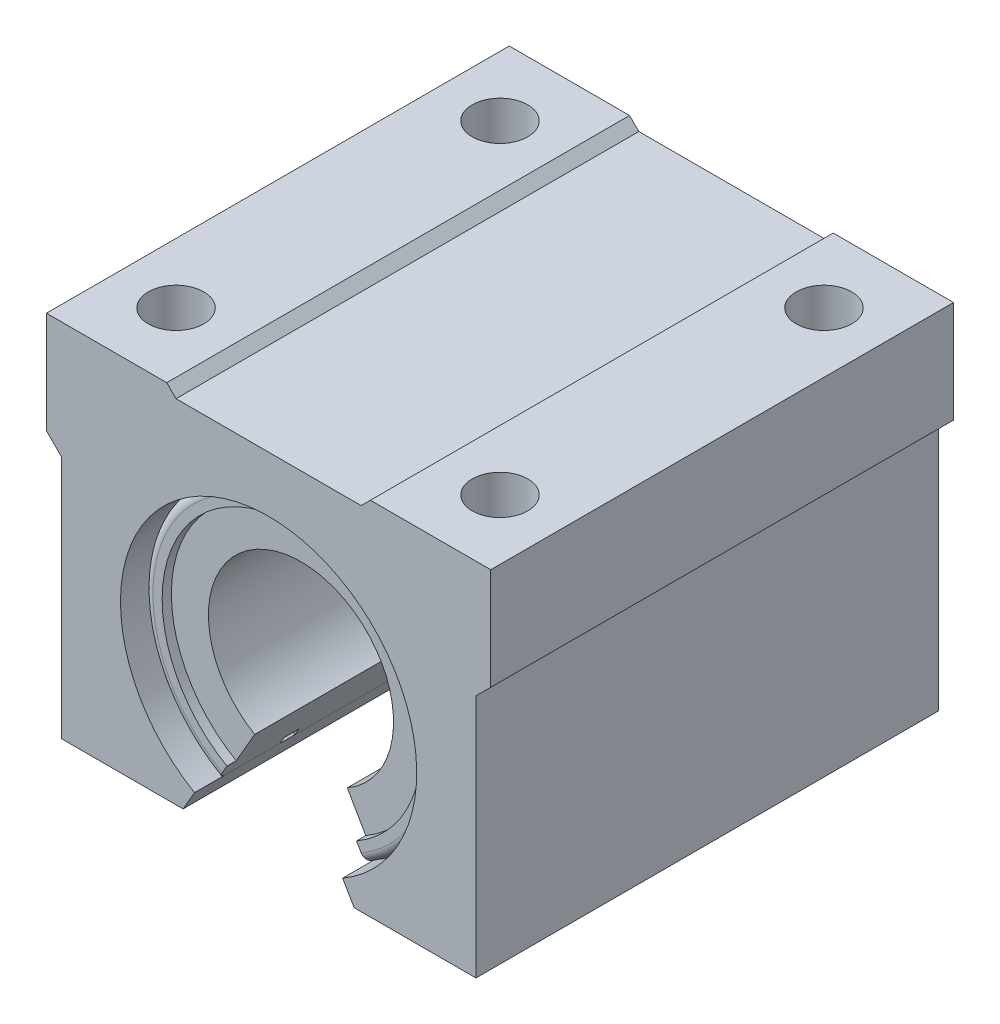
ISO-10303-21;
HEADER;
FILE_DESCRIPTION(('STEP AP214'),'2;1');
FILE_NAME('part.step','',(''),(''),'','','');
FILE_SCHEMA(('AUTOMOTIVE_DESIGN { 1 0 10303 214 1 1 1 1 }'));
ENDSEC;
DATA;
#1=APPLICATION_CONTEXT('core data for automotive mechanical design processes');
#2=APPLICATION_PROTOCOL_DEFINITION('international standard','automotive_design',2000,#1);
#3=PRODUCT_CONTEXT('',#1,'mechanical');
#4=PRODUCT('Part','Part','',(#3));
#5=PRODUCT_RELATED_PRODUCT_CATEGORY('part','',(#4));
#6=PRODUCT_DEFINITION_FORMATION('','',#4);
#7=PRODUCT_DEFINITION_CONTEXT('part definition',#1,'design');
#8=PRODUCT_DEFINITION('design','',#6,#7);
#9=PRODUCT_DEFINITION_SHAPE('','',#8);
#10=(LENGTH_UNIT() NAMED_UNIT(*) SI_UNIT(.MILLI.,.METRE.));
#11=(NAMED_UNIT(*) PLANE_ANGLE_UNIT() SI_UNIT($,.RADIAN.));
#12=(NAMED_UNIT(*) SI_UNIT($,.STERADIAN.) SOLID_ANGLE_UNIT());
#13=UNCERTAINTY_MEASURE_WITH_UNIT(LENGTH_MEASURE(1.E-05),#10,'distance_accuracy_value','');
#14=(GEOMETRIC_REPRESENTATION_CONTEXT(3) GLOBAL_UNCERTAINTY_ASSIGNED_CONTEXT((#13)) GLOBAL_UNIT_ASSIGNED_CONTEXT((#10,
#11,#12)) REPRESENTATION_CONTEXT('',''));
#15=CARTESIAN_POINT('',(0.,0.,0.));
#16=DIRECTION('',(0.,0.,1.));
#17=DIRECTION('',(1.,0.,0.));
#18=AXIS2_PLACEMENT_3D('',#15,#16,#17);
#19=CARTESIAN_POINT('',(0.,0.,22.5));
#20=DIRECTION('',(0.,0.,-1.));
#21=DIRECTION('',(-1.,0.,0.));
#22=AXIS2_PLACEMENT_3D('',#19,#20,#21);
#23=CYLINDRICAL_SURFACE('',#22,10.);
#24=DIRECTION('',(0.,0.,-1.));
#25=VECTOR('',#24,1.);
#26=CARTESIAN_POINT('',(5.00000000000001,-8.66025403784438,22.5));
#27=LINE('',#26,#25);
#28=CARTESIAN_POINT('',(5.00000000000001,-8.66025403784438,21.5));
#29=VERTEX_POINT('',#28);
#30=CARTESIAN_POINT('',(5.00000000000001,-8.66025403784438,-21.5));
#31=VERTEX_POINT('',#30);
#32=EDGE_CURVE('P0_E38',#29,#31,#27,.T.);
#33=ORIENTED_EDGE('',*,*,#32,.F.);
#34=CARTESIAN_POINT('',(0.,0.,21.5));
#35=DIRECTION('',(0.,0.,1.));
#36=DIRECTION('',(1.,0.,0.));
#37=AXIS2_PLACEMENT_3D('',#34,#35,#36);
#38=CIRCLE('',#37,10.);
#39=CARTESIAN_POINT('',(-5.00000000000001,-8.66025403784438,21.5));
#40=VERTEX_POINT('',#39);
#41=EDGE_CURVE('P0_E168',#29,#40,#38,.T.);
#42=ORIENTED_EDGE('',*,*,#41,.T.);
#43=DIRECTION('',(0.,0.,-1.));
#44=VECTOR('',#43,1.);
#45=CARTESIAN_POINT('',(-5.00000000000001,-8.66025403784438,22.5));
#46=LINE('',#45,#44);
#47=CARTESIAN_POINT('',(-5.00000000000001,-8.66025403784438,-21.5));
#48=VERTEX_POINT('',#47);
#49=EDGE_CURVE('P0_E211',#48,#40,#46,.F.);
#50=ORIENTED_EDGE('',*,*,#49,.F.);
#51=CARTESIAN_POINT('',(0.,0.,-21.5));
#52=DIRECTION('',(0.,0.,-1.));
#53=DIRECTION('',(-1.,0.,0.));
#54=AXIS2_PLACEMENT_3D('',#51,#52,#53);
#55=CIRCLE('',#54,10.);
#56=EDGE_CURVE('P0_E166',#48,#31,#55,.T.);
#57=ORIENTED_EDGE('',*,*,#56,.T.);
#58=EDGE_LOOP('',(#33,#42,#50,#57));
#59=FACE_BOUND('',#58,.T.);
#60=ADVANCED_FACE('P0_F16',(#59),#23,.F.);
#61=CARTESIAN_POINT('',(0.,0.,-22.5));
#62=DIRECTION('',(0.,0.,1.));
#63=DIRECTION('',(1.,0.,0.));
#64=AXIS2_PLACEMENT_3D('',#61,#62,#63);
#65=PLANE('',#64);
#66=CARTESIAN_POINT('',(0.,0.,-22.5));
#67=DIRECTION('',(0.,0.,1.));
#68=DIRECTION('',(1.,0.,0.));
#69=AXIS2_PLACEMENT_3D('',#66,#67,#68);
#70=CIRCLE('',#69,15.);
#71=CARTESIAN_POINT('',(-7.50000000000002,-12.9903810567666,-22.5));
#72=VERTEX_POINT('',#71);
#73=CARTESIAN_POINT('',(7.50000000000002,-12.9903810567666,-22.5));
#74=VERTEX_POINT('',#73);
#75=EDGE_CURVE('P0_E202',#72,#74,#70,.F.);
#76=ORIENTED_EDGE('',*,*,#75,.T.);
#77=DIRECTION('',(-0.500000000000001,0.866025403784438,0.));
#78=VECTOR('',#77,1.);
#79=CARTESIAN_POINT('',(0.,0.,-22.5));
#80=LINE('',#79,#78);
#81=CARTESIAN_POINT('',(7.00000000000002,-12.1243556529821,-22.5));
#82=VERTEX_POINT('',#81);
#83=EDGE_CURVE('P0_E159',#74,#82,#80,.T.);
#84=ORIENTED_EDGE('',*,*,#83,.T.);
#85=CARTESIAN_POINT('',(0.,0.,-22.5));
#86=DIRECTION('',(0.,0.,1.));
#87=DIRECTION('',(1.,0.,0.));
#88=AXIS2_PLACEMENT_3D('',#85,#86,#87);
#89=CIRCLE('',#88,14.);
#90=CARTESIAN_POINT('',(-7.00000000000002,-12.1243556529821,-22.5));
#91=VERTEX_POINT('',#90);
#92=EDGE_CURVE('P0_E228',#82,#91,#89,.T.);
#93=ORIENTED_EDGE('',*,*,#92,.T.);
#94=DIRECTION('',(-0.500000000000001,-0.866025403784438,0.));
#95=VECTOR('',#94,1.);
#96=CARTESIAN_POINT('',(0.,0.,-22.5));
#97=LINE('',#96,#95);
#98=EDGE_CURVE('P0_E258',#91,#72,#97,.T.);
#99=ORIENTED_EDGE('',*,*,#98,.T.);
#100=EDGE_LOOP('',(#76,#84,#93,#99));
#101=FACE_BOUND('',#100,.T.);
#102=ADVANCED_FACE('P0_F257',(#101),#65,.F.);
#103=CARTESIAN_POINT('',(0.,0.,22.5));
#104=DIRECTION('',(0.,0.,-1.));
#105=DIRECTION('',(-1.,0.,0.));
#106=AXIS2_PLACEMENT_3D('',#103,#104,#105);
#107=CYLINDRICAL_SURFACE('',#106,16.);
#108=CARTESIAN_POINT('',(0.,0.,14.15));
#109=DIRECTION('',(0.,0.,1.));
#110=DIRECTION('',(1.,0.,0.));
#111=AXIS2_PLACEMENT_3D('',#108,#109,#110);
#112=CIRCLE('',#111,16.);
#113=CARTESIAN_POINT('',(8.00000000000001,-13.856406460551,14.15));
#114=VERTEX_POINT('',#113);
#115=CARTESIAN_POINT('',(-8.00000000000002,-13.856406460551,14.15));
#116=VERTEX_POINT('',#115);
#117=EDGE_CURVE('P0_E187',#114,#116,#112,.T.);
#118=ORIENTED_EDGE('',*,*,#117,.F.);
#119=DIRECTION('',(0.,0.,1.));
#120=VECTOR('',#119,1.);
#121=CARTESIAN_POINT('',(8.00000000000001,-13.856406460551,-22.5));
#122=LINE('',#121,#120);
#123=CARTESIAN_POINT('',(8.00000000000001,-13.856406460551,-14.15));
#124=VERTEX_POINT('',#123);
#125=EDGE_CURVE('P0_E268',#124,#114,#122,.T.);
#126=ORIENTED_EDGE('',*,*,#125,.F.);
#127=CARTESIAN_POINT('',(0.,0.,-14.15));
#128=DIRECTION('',(0.,0.,1.));
#129=DIRECTION('',(1.,0.,0.));
#130=AXIS2_PLACEMENT_3D('',#127,#128,#129);
#131=CIRCLE('',#130,16.);
#132=CARTESIAN_POINT('',(-8.00000000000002,-13.856406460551,-14.15));
#133=VERTEX_POINT('',#132);
#134=EDGE_CURVE('P0_E184',#124,#133,#131,.T.);
#135=ORIENTED_EDGE('',*,*,#134,.T.);
#136=DIRECTION('',(0.,0.,1.));
#137=VECTOR('',#136,1.);
#138=CARTESIAN_POINT('',(-8.00000000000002,-13.856406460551,-22.5));
#139=LINE('',#138,#137);
#140=EDGE_CURVE('P0_E273',#133,#116,#139,.T.);
#141=ORIENTED_EDGE('',*,*,#140,.T.);
#142=EDGE_LOOP('',(#118,#126,#135,#141));
#143=FACE_BOUND('',#142,.T.);
#144=ADVANCED_FACE('P0_F325',(#143),#107,.T.);
#145=CARTESIAN_POINT('',(0.,0.,-15.75));
#146=DIRECTION('',(0.,0.,1.));
#147=DIRECTION('',(1.,0.,0.));
#148=AXIS2_PLACEMENT_3D('',#145,#146,#147);
#149=CIRCLE('',#148,16.);
#150=CARTESIAN_POINT('',(8.00000000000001,-13.856406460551,-15.75));
#151=VERTEX_POINT('',#150);
#152=CARTESIAN_POINT('',(-8.00000000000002,-13.856406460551,-15.75));
#153=VERTEX_POINT('',#152);
#154=EDGE_CURVE('P0_E181',#151,#153,#149,.T.);
#155=ORIENTED_EDGE('',*,*,#154,.F.);
#156=CARTESIAN_POINT('',(8.00000000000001,-13.856406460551,-21.5));
#157=VERTEX_POINT('',#156);
#158=EDGE_CURVE('P0_E270',#157,#151,#122,.T.);
#159=ORIENTED_EDGE('',*,*,#158,.F.);
#160=CARTESIAN_POINT('',(0.,0.,-21.5));
#161=DIRECTION('',(0.,0.,1.));
#162=DIRECTION('',(1.,0.,0.));
#163=AXIS2_PLACEMENT_3D('',#160,#161,#162);
#164=CIRCLE('',#163,16.);
#165=CARTESIAN_POINT('',(-8.00000000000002,-13.856406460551,-21.5));
#166=VERTEX_POINT('',#165);
#167=EDGE_CURVE('P0_E199',#157,#166,#164,.T.);
#168=ORIENTED_EDGE('',*,*,#167,.T.);
#169=EDGE_CURVE('P0_E269',#166,#153,#139,.T.);
#170=ORIENTED_EDGE('',*,*,#169,.T.);
#171=EDGE_LOOP('',(#155,#159,#168,#170));
#172=FACE_BOUND('',#171,.T.);
#173=ADVANCED_FACE('P0_F333',(#172),#107,.T.);
#174=CARTESIAN_POINT('',(0.,0.,21.5));
#175=DIRECTION('',(0.,0.,1.));
#176=DIRECTION('',(1.,0.,0.));
#177=AXIS2_PLACEMENT_3D('',#174,#175,#176);
#178=CIRCLE('',#177,16.);
#179=CARTESIAN_POINT('',(-8.00000000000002,-13.856406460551,21.5));
#180=VERTEX_POINT('',#179);
#181=CARTESIAN_POINT('',(8.00000000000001,-13.856406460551,21.5));
#182=VERTEX_POINT('',#181);
#183=EDGE_CURVE('P0_E206',#180,#182,#178,.F.);
#184=ORIENTED_EDGE('',*,*,#183,.T.);
#185=CARTESIAN_POINT('',(8.00000000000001,-13.856406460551,15.75));
#186=VERTEX_POINT('',#185);
#187=EDGE_CURVE('P0_E266',#186,#182,#122,.T.);
#188=ORIENTED_EDGE('',*,*,#187,.F.);
#189=CARTESIAN_POINT('',(0.,0.,15.75));
#190=DIRECTION('',(0.,0.,1.));
#191=DIRECTION('',(1.,0.,0.));
#192=AXIS2_PLACEMENT_3D('',#189,#190,#191);
#193=CIRCLE('',#192,16.);
#194=CARTESIAN_POINT('',(-8.00000000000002,-13.856406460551,15.75));
#195=VERTEX_POINT('',#194);
#196=EDGE_CURVE('P0_E196',#186,#195,#193,.T.);
#197=ORIENTED_EDGE('',*,*,#196,.T.);
#198=EDGE_CURVE('P0_E262',#195,#180,#139,.T.);
#199=ORIENTED_EDGE('',*,*,#198,.T.);
#200=EDGE_LOOP('',(#184,#188,#197,#199));
#201=FACE_BOUND('',#200,.T.);
#202=ADVANCED_FACE('P0_F305',(#201),#107,.T.);
#203=CARTESIAN_POINT('',(0.,0.,22.5));
#204=DIRECTION('',(0.,0.,1.));
#205=DIRECTION('',(1.,0.,0.));
#206=AXIS2_PLACEMENT_3D('',#203,#204,#205);
#207=PLANE('',#206);
#208=DIRECTION('',(-0.500000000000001,0.866025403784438,0.));
#209=VECTOR('',#208,1.);
#210=CARTESIAN_POINT('',(0.,0.,22.5));
#211=LINE('',#210,#209);
#212=CARTESIAN_POINT('',(7.50000000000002,-12.9903810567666,22.5));
#213=VERTEX_POINT('',#212);
#214=CARTESIAN_POINT('',(7.00000000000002,-12.1243556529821,22.5));
#215=VERTEX_POINT('',#214);
#216=EDGE_CURVE('P0_E160',#213,#215,#211,.T.);
#217=ORIENTED_EDGE('',*,*,#216,.F.);
#218=CARTESIAN_POINT('',(0.,0.,22.5));
#219=DIRECTION('',(0.,0.,1.));
#220=DIRECTION('',(1.,0.,0.));
#221=AXIS2_PLACEMENT_3D('',#218,#219,#220);
#222=CIRCLE('',#221,15.);
#223=CARTESIAN_POINT('',(-7.50000000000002,-12.9903810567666,22.5));
#224=VERTEX_POINT('',#223);
#225=EDGE_CURVE('P0_E158',#213,#224,#222,.T.);
#226=ORIENTED_EDGE('',*,*,#225,.T.);
#227=DIRECTION('',(-0.500000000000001,-0.866025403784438,0.));
#228=VECTOR('',#227,1.);
#229=CARTESIAN_POINT('',(0.,0.,22.5));
#230=LINE('',#229,#228);
#231=CARTESIAN_POINT('',(-7.00000000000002,-12.1243556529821,22.5));
#232=VERTEX_POINT('',#231);
#233=EDGE_CURVE('P0_E141',#232,#224,#230,.T.);
#234=ORIENTED_EDGE('',*,*,#233,.F.);
#235=CARTESIAN_POINT('',(0.,0.,22.5));
#236=DIRECTION('',(0.,0.,1.));
#237=DIRECTION('',(1.,0.,0.));
#238=AXIS2_PLACEMENT_3D('',#235,#236,#237);
#239=CIRCLE('',#238,14.);
#240=EDGE_CURVE('P0_E156',#215,#232,#239,.T.);
#241=ORIENTED_EDGE('',*,*,#240,.F.);
#242=EDGE_LOOP('',(#217,#226,#234,#241));
#243=FACE_BOUND('',#242,.T.);
#244=ADVANCED_FACE('P0_F155',(#243),#207,.T.);
#245=CARTESIAN_POINT('',(-1.1172740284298E-13,-16.,15.75));
#246=DIRECTION('',(0.,0.,-1.));
#247=DIRECTION('',(-1.,0.,0.));
#248=AXIS2_PLACEMENT_3D('',#245,#246,#247);
#249=PLANE('',#248);
#250=DIRECTION('',(0.500000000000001,-0.866025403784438,0.));
#251=VECTOR('',#250,1.);
#252=CARTESIAN_POINT('',(6.92820323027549,-11.9999999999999,15.75));
#253=LINE('',#252,#251);
#254=CARTESIAN_POINT('',(7.57500000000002,-13.1202848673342,15.75));
#255=VERTEX_POINT('',#254);
#256=EDGE_CURVE('P0_E253',#255,#186,#253,.T.);
#257=ORIENTED_EDGE('',*,*,#256,.F.);
#258=CARTESIAN_POINT('',(0.,0.,15.75));
#259=DIRECTION('',(0.,0.,1.));
#260=DIRECTION('',(1.,0.,0.));
#261=AXIS2_PLACEMENT_3D('',#258,#259,#260);
#262=CIRCLE('',#261,15.15);
#263=CARTESIAN_POINT('',(-7.57500000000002,-13.1202848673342,15.75));
#264=VERTEX_POINT('',#263);
#265=EDGE_CURVE('P0_E193',#255,#264,#262,.T.);
#266=ORIENTED_EDGE('',*,*,#265,.T.);
#267=DIRECTION('',(0.500000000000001,0.866025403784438,0.));
#268=VECTOR('',#267,1.);
#269=CARTESIAN_POINT('',(-6.92820323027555,-12.,15.75));
#270=LINE('',#269,#268);
#271=EDGE_CURVE('P0_E229',#195,#264,#270,.T.);
#272=ORIENTED_EDGE('',*,*,#271,.F.);
#273=ORIENTED_EDGE('',*,*,#196,.F.);
#274=EDGE_LOOP('',(#257,#266,#272,#273));
#275=FACE_BOUND('',#274,.T.);
#276=ADVANCED_FACE('P0_F303',(#275),#249,.T.);
#277=CARTESIAN_POINT('',(0.,0.,0.));
#278=DIRECTION('',(0.,0.,1.));
#279=DIRECTION('',(1.,0.,0.));
#280=AXIS2_PLACEMENT_3D('',#277,#278,#279);
#281=CYLINDRICAL_SURFACE('',#280,15.15);
#282=DIRECTION('',(0.,0.,1.));
#283=VECTOR('',#282,1.);
#284=CARTESIAN_POINT('',(7.57500000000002,-13.1202848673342,0.));
#285=LINE('',#284,#283);
#286=CARTESIAN_POINT('',(7.57500000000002,-13.1202848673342,14.15));
#287=VERTEX_POINT('',#286);
#288=EDGE_CURVE('P0_E251',#287,#255,#285,.T.);
#289=ORIENTED_EDGE('',*,*,#288,.F.);
#290=CARTESIAN_POINT('',(0.,0.,14.15));
#291=DIRECTION('',(0.,0.,1.));
#292=DIRECTION('',(1.,0.,0.));
#293=AXIS2_PLACEMENT_3D('',#290,#291,#292);
#294=CIRCLE('',#293,15.15);
#295=CARTESIAN_POINT('',(-7.57500000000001,-13.1202848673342,14.15));
#296=VERTEX_POINT('',#295);
#297=EDGE_CURVE('P0_E190',#287,#296,#294,.T.);
#298=ORIENTED_EDGE('',*,*,#297,.T.);
#299=DIRECTION('',(0.,0.,1.));
#300=VECTOR('',#299,1.);
#301=CARTESIAN_POINT('',(-7.57500000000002,-13.1202848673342,0.));
#302=LINE('',#301,#300);
#303=EDGE_CURVE('P0_E233',#264,#296,#302,.F.);
#304=ORIENTED_EDGE('',*,*,#303,.F.);
#305=ORIENTED_EDGE('',*,*,#265,.F.);
#306=EDGE_LOOP('',(#289,#298,#304,#305));
#307=FACE_BOUND('',#306,.T.);
#308=ADVANCED_FACE('P0_F298',(#307),#281,.T.);
#309=CARTESIAN_POINT('',(-1.05791884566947E-13,-15.15,14.15));
#310=DIRECTION('',(0.,0.,1.));
#311=DIRECTION('',(1.,0.,0.));
#312=AXIS2_PLACEMENT_3D('',#309,#310,#311);
#313=PLANE('',#312);
#314=DIRECTION('',(-0.500000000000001,0.866025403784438,0.));
#315=VECTOR('',#314,1.);
#316=CARTESIAN_POINT('',(6.5601424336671,-11.3624999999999,14.15));
#317=LINE('',#316,#315);
#318=EDGE_CURVE('P0_E249',#114,#287,#317,.T.);
#319=ORIENTED_EDGE('',*,*,#318,.F.);
#320=ORIENTED_EDGE('',*,*,#117,.T.);
#321=DIRECTION('',(-0.500000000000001,-0.866025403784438,0.));
#322=VECTOR('',#321,1.);
#323=CARTESIAN_POINT('',(-6.56014243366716,-11.3625,14.15));
#324=LINE('',#323,#322);
#325=EDGE_CURVE('P0_E285',#296,#116,#324,.T.);
#326=ORIENTED_EDGE('',*,*,#325,.F.);
#327=ORIENTED_EDGE('',*,*,#297,.F.);
#328=EDGE_LOOP('',(#319,#320,#326,#327));
#329=FACE_BOUND('',#328,.T.);
#330=ADVANCED_FACE('P0_F295',(#329),#313,.T.);
#331=CARTESIAN_POINT('',(-1.05791884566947E-13,-15.15,-14.15));
#332=DIRECTION('',(0.,0.,-1.));
#333=DIRECTION('',(-1.,0.,0.));
#334=AXIS2_PLACEMENT_3D('',#331,#332,#333);
#335=PLANE('',#334);
#336=DIRECTION('',(0.500000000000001,-0.866025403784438,0.));
#337=VECTOR('',#336,1.);
#338=CARTESIAN_POINT('',(6.5601424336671,-11.3624999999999,-14.15));
#339=LINE('',#338,#337);
#340=CARTESIAN_POINT('',(7.57500000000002,-13.1202848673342,-14.15));
#341=VERTEX_POINT('',#340);
#342=EDGE_CURVE('P0_E247',#341,#124,#339,.T.);
#343=ORIENTED_EDGE('',*,*,#342,.F.);
#344=CARTESIAN_POINT('',(0.,0.,-14.15));
#345=DIRECTION('',(0.,0.,1.));
#346=DIRECTION('',(1.,0.,0.));
#347=AXIS2_PLACEMENT_3D('',#344,#345,#346);
#348=CIRCLE('',#347,15.15);
#349=CARTESIAN_POINT('',(-7.57500000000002,-13.1202848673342,-14.15));
#350=VERTEX_POINT('',#349);
#351=EDGE_CURVE('P0_E175',#341,#350,#348,.T.);
#352=ORIENTED_EDGE('',*,*,#351,.T.);
#353=DIRECTION('',(0.500000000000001,0.866025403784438,0.));
#354=VECTOR('',#353,1.);
#355=CARTESIAN_POINT('',(-6.56014243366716,-11.3625,-14.15));
#356=LINE('',#355,#354);
#357=EDGE_CURVE('P0_E283',#133,#350,#356,.T.);
#358=ORIENTED_EDGE('',*,*,#357,.F.);
#359=ORIENTED_EDGE('',*,*,#134,.F.);
#360=EDGE_LOOP('',(#343,#352,#358,#359));
#361=FACE_BOUND('',#360,.T.);
#362=ADVANCED_FACE('P0_F361',(#361),#335,.T.);
#363=CARTESIAN_POINT('',(-1.1172740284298E-13,-16.,-15.75));
#364=DIRECTION('',(0.,0.,1.));
#365=DIRECTION('',(1.,0.,0.));
#366=AXIS2_PLACEMENT_3D('',#363,#364,#365);
#367=PLANE('',#366);
#368=DIRECTION('',(-0.500000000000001,0.866025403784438,0.));
#369=VECTOR('',#368,1.);
#370=CARTESIAN_POINT('',(6.92820323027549,-11.9999999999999,-15.75));
#371=LINE('',#370,#369);
#372=CARTESIAN_POINT('',(7.57500000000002,-13.1202848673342,-15.75));
#373=VERTEX_POINT('',#372);
#374=EDGE_CURVE('P0_E245',#151,#373,#371,.T.);
#375=ORIENTED_EDGE('',*,*,#374,.F.);
#376=ORIENTED_EDGE('',*,*,#154,.T.);
#377=DIRECTION('',(-0.500000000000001,-0.866025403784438,0.));
#378=VECTOR('',#377,1.);
#379=CARTESIAN_POINT('',(-6.92820323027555,-12.,-15.75));
#380=LINE('',#379,#378);
#381=CARTESIAN_POINT('',(-7.57500000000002,-13.1202848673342,-15.75));
#382=VERTEX_POINT('',#381);
#383=EDGE_CURVE('P0_E281',#382,#153,#380,.T.);
#384=ORIENTED_EDGE('',*,*,#383,.F.);
#385=CARTESIAN_POINT('',(0.,0.,-15.75));
#386=DIRECTION('',(0.,0.,1.));
#387=DIRECTION('',(1.,0.,0.));
#388=AXIS2_PLACEMENT_3D('',#385,#386,#387);
#389=CIRCLE('',#388,15.15);
#390=EDGE_CURVE('P0_E178',#373,#382,#389,.T.);
#391=ORIENTED_EDGE('',*,*,#390,.F.);
#392=EDGE_LOOP('',(#375,#376,#384,#391));
#393=FACE_BOUND('',#392,.T.);
#394=ADVANCED_FACE('P0_F353',(#393),#367,.T.);
#395=CARTESIAN_POINT('',(0.,0.,0.));
#396=DIRECTION('',(0.,0.,1.));
#397=DIRECTION('',(1.,0.,0.));
#398=AXIS2_PLACEMENT_3D('',#395,#396,#397);
#399=CYLINDRICAL_SURFACE('',#398,15.15);
#400=DIRECTION('',(0.,0.,1.));
#401=VECTOR('',#400,1.);
#402=CARTESIAN_POINT('',(7.57500000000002,-13.1202848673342,0.));
#403=LINE('',#402,#401);
#404=EDGE_CURVE('P0_E243',#373,#341,#403,.T.);
#405=ORIENTED_EDGE('',*,*,#404,.F.);
#406=ORIENTED_EDGE('',*,*,#390,.T.);
#407=DIRECTION('',(0.,0.,1.));
#408=VECTOR('',#407,1.);
#409=CARTESIAN_POINT('',(-7.57500000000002,-13.1202848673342,0.));
#410=LINE('',#409,#408);
#411=EDGE_CURVE('P0_E279',#350,#382,#410,.F.);
#412=ORIENTED_EDGE('',*,*,#411,.F.);
#413=ORIENTED_EDGE('',*,*,#351,.F.);
#414=EDGE_LOOP('',(#405,#406,#412,#413));
#415=FACE_BOUND('',#414,.T.);
#416=ADVANCED_FACE('P0_F318',(#415),#399,.T.);
#417=CARTESIAN_POINT('',(0.,0.,-21.5));
#418=DIRECTION('',(0.,0.,1.));
#419=DIRECTION('',(1.,0.,0.));
#420=AXIS2_PLACEMENT_3D('',#417,#418,#419);
#421=TOROIDAL_SURFACE('',#420,15.,1.);
#422=CARTESIAN_POINT('',(7.50000000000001,-12.9903810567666,-21.5));
#423=DIRECTION('',(0.866025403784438,0.500000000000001,0.));
#424=DIRECTION('',(-0.500000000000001,0.866025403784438,0.));
#425=AXIS2_PLACEMENT_3D('',#422,#423,#424);
#426=CIRCLE('',#425,1.);
#427=EDGE_CURVE('P0_E241',#74,#157,#426,.F.);
#428=ORIENTED_EDGE('',*,*,#427,.F.);
#429=ORIENTED_EDGE('',*,*,#75,.F.);
#430=CARTESIAN_POINT('',(-7.50000000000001,-12.9903810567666,-21.5));
#431=DIRECTION('',(-0.866025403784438,0.500000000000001,0.));
#432=DIRECTION('',(-0.500000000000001,-0.866025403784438,0.));
#433=AXIS2_PLACEMENT_3D('',#430,#431,#432);
#434=CIRCLE('',#433,1.);
#435=EDGE_CURVE('P0_E277',#166,#72,#434,.F.);
#436=ORIENTED_EDGE('',*,*,#435,.F.);
#437=ORIENTED_EDGE('',*,*,#167,.F.);
#438=EDGE_LOOP('',(#428,#429,#436,#437));
#439=FACE_BOUND('',#438,.T.);
#440=ADVANCED_FACE('P0_F310',(#439),#421,.T.);
#441=CARTESIAN_POINT('',(0.,0.,21.5));
#442=DIRECTION('',(0.,0.,1.));
#443=DIRECTION('',(1.,0.,0.));
#444=AXIS2_PLACEMENT_3D('',#441,#442,#443);
#445=TOROIDAL_SURFACE('',#444,15.,1.);
#446=CARTESIAN_POINT('',(7.50000000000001,-12.9903810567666,21.5));
#447=DIRECTION('',(0.866025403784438,0.500000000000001,0.));
#448=DIRECTION('',(-0.500000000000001,0.866025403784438,0.));
#449=AXIS2_PLACEMENT_3D('',#446,#447,#448);
#450=CIRCLE('',#449,1.);
#451=EDGE_CURVE('P0_E239',#182,#213,#450,.F.);
#452=ORIENTED_EDGE('',*,*,#451,.F.);
#453=ORIENTED_EDGE('',*,*,#183,.F.);
#454=CARTESIAN_POINT('',(-7.50000000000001,-12.9903810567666,21.5));
#455=DIRECTION('',(-0.866025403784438,0.500000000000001,0.));
#456=DIRECTION('',(-0.500000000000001,-0.866025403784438,0.));
#457=AXIS2_PLACEMENT_3D('',#454,#455,#456);
#458=CIRCLE('',#457,1.);
#459=EDGE_CURVE('P0_E149',#224,#180,#458,.F.);
#460=ORIENTED_EDGE('',*,*,#459,.F.);
#461=ORIENTED_EDGE('',*,*,#225,.F.);
#462=EDGE_LOOP('',(#452,#453,#460,#461));
#463=FACE_BOUND('',#462,.T.);
#464=ADVANCED_FACE('P0_F18',(#463),#445,.T.);
#465=CARTESIAN_POINT('',(0.,0.,21.5));
#466=DIRECTION('',(0.,0.,1.));
#467=DIRECTION('',(1.,0.,0.));
#468=AXIS2_PLACEMENT_3D('',#465,#466,#467);
#469=CYLINDRICAL_SURFACE('',#468,14.);
#470=CARTESIAN_POINT('',(0.,0.,21.5));
#471=DIRECTION('',(0.,0.,1.));
#472=DIRECTION('',(1.,0.,0.));
#473=AXIS2_PLACEMENT_3D('',#470,#471,#472);
#474=CIRCLE('',#473,14.);
#475=CARTESIAN_POINT('',(7.00000000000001,-12.1243556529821,21.5));
#476=VERTEX_POINT('',#475);
#477=CARTESIAN_POINT('',(-7.00000000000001,-12.1243556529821,21.5));
#478=VERTEX_POINT('',#477);
#479=EDGE_CURVE('P0_E165',#476,#478,#474,.T.);
#480=ORIENTED_EDGE('',*,*,#479,.F.);
#481=DIRECTION('',(0.,0.,1.));
#482=VECTOR('',#481,1.);
#483=CARTESIAN_POINT('',(7.00000000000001,-12.1243556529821,21.5));
#484=LINE('',#483,#482);
#485=EDGE_CURVE('P0_E164',#476,#215,#484,.T.);
#486=ORIENTED_EDGE('',*,*,#485,.T.);
#487=ORIENTED_EDGE('',*,*,#240,.T.);
#488=DIRECTION('',(0.,0.,1.));
#489=VECTOR('',#488,1.);
#490=CARTESIAN_POINT('',(-7.00000000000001,-12.1243556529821,21.5));
#491=LINE('',#490,#489);
#492=EDGE_CURVE('P0_E138',#232,#478,#491,.F.);
#493=ORIENTED_EDGE('',*,*,#492,.T.);
#494=EDGE_LOOP('',(#480,#486,#487,#493));
#495=FACE_BOUND('',#494,.T.);
#496=ADVANCED_FACE('P0_F163',(#495),#469,.F.);
#497=CARTESIAN_POINT('',(0.,0.,21.5));
#498=DIRECTION('',(0.,0.,1.));
#499=DIRECTION('',(1.,0.,0.));
#500=AXIS2_PLACEMENT_3D('',#497,#498,#499);
#501=PLANE('',#500);
#502=DIRECTION('',(-0.500000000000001,0.866025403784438,0.));
#503=VECTOR('',#502,1.);
#504=CARTESIAN_POINT('',(0.,0.,21.5));
#505=LINE('',#504,#503);
#506=EDGE_CURVE('P0_E231',#476,#29,#505,.T.);
#507=ORIENTED_EDGE('',*,*,#506,.F.);
#508=ORIENTED_EDGE('',*,*,#479,.T.);
#509=DIRECTION('',(-0.500000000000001,-0.866025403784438,0.));
#510=VECTOR('',#509,1.);
#511=CARTESIAN_POINT('',(0.,0.,21.5));
#512=LINE('',#511,#510);
#513=EDGE_CURVE('P0_E144',#40,#478,#512,.T.);
#514=ORIENTED_EDGE('',*,*,#513,.F.);
#515=ORIENTED_EDGE('',*,*,#41,.F.);
#516=EDGE_LOOP('',(#507,#508,#514,#515));
#517=FACE_BOUND('',#516,.T.);
#518=ADVANCED_FACE('P0_F316',(#517),#501,.T.);
#519=CARTESIAN_POINT('',(0.,0.,-21.5));
#520=DIRECTION('',(0.,0.,-1.));
#521=DIRECTION('',(-1.,0.,0.));
#522=AXIS2_PLACEMENT_3D('',#519,#520,#521);
#523=CYLINDRICAL_SURFACE('',#522,14.);
#524=DIRECTION('',(0.,0.,-1.));
#525=VECTOR('',#524,1.);
#526=CARTESIAN_POINT('',(7.00000000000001,-12.1243556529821,-21.5));
#527=LINE('',#526,#525);
#528=CARTESIAN_POINT('',(7.00000000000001,-12.1243556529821,-21.5));
#529=VERTEX_POINT('',#528);
#530=EDGE_CURVE('P0_E222',#529,#82,#527,.T.);
#531=ORIENTED_EDGE('',*,*,#530,.F.);
#532=CARTESIAN_POINT('',(0.,0.,-21.5));
#533=DIRECTION('',(0.,0.,1.));
#534=DIRECTION('',(1.,0.,0.));
#535=AXIS2_PLACEMENT_3D('',#532,#533,#534);
#536=CIRCLE('',#535,14.);
#537=CARTESIAN_POINT('',(-7.00000000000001,-12.1243556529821,-21.5));
#538=VERTEX_POINT('',#537);
#539=EDGE_CURVE('P0_E171',#529,#538,#536,.T.);
#540=ORIENTED_EDGE('',*,*,#539,.T.);
#541=DIRECTION('',(0.,0.,-1.));
#542=VECTOR('',#541,1.);
#543=CARTESIAN_POINT('',(-7.00000000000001,-12.1243556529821,-21.5));
#544=LINE('',#543,#542);
#545=EDGE_CURVE('P0_E31',#91,#538,#544,.F.);
#546=ORIENTED_EDGE('',*,*,#545,.F.);
#547=ORIENTED_EDGE('',*,*,#92,.F.);
#548=EDGE_LOOP('',(#531,#540,#546,#547));
#549=FACE_BOUND('',#548,.T.);
#550=ADVANCED_FACE('P0_F226',(#549),#523,.F.);
#551=CARTESIAN_POINT('',(0.,0.,-21.5));
#552=DIRECTION('',(0.,0.,-1.));
#553=DIRECTION('',(1.,0.,0.));
#554=AXIS2_PLACEMENT_3D('',#551,#552,#553);
#555=PLANE('',#554);
#556=DIRECTION('',(0.500000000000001,-0.866025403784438,0.));
#557=VECTOR('',#556,1.);
#558=CARTESIAN_POINT('',(0.,0.,-21.5));
#559=LINE('',#558,#557);
#560=EDGE_CURVE('P0_E11',#31,#529,#559,.T.);
#561=ORIENTED_EDGE('',*,*,#560,.F.);
#562=ORIENTED_EDGE('',*,*,#56,.F.);
#563=DIRECTION('',(0.500000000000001,0.866025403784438,0.));
#564=VECTOR('',#563,1.);
#565=CARTESIAN_POINT('',(0.,0.,-21.5));
#566=LINE('',#565,#564);
#567=EDGE_CURVE('P0_E24',#538,#48,#566,.T.);
#568=ORIENTED_EDGE('',*,*,#567,.F.);
#569=ORIENTED_EDGE('',*,*,#539,.F.);
#570=EDGE_LOOP('',(#561,#562,#568,#569));
#571=FACE_BOUND('',#570,.T.);
#572=ADVANCED_FACE('P0_F219',(#571),#555,.T.);
#573=CARTESIAN_POINT('',(0.,0.,-22.5));
#574=DIRECTION('',(-0.866025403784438,0.500000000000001,0.));
#575=DIRECTION('',(-0.500000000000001,-0.866025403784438,0.));
#576=AXIS2_PLACEMENT_3D('',#573,#574,#575);
#577=PLANE('',#576);
#578=ORIENTED_EDGE('',*,*,#271,.T.);
#579=ORIENTED_EDGE('',*,*,#303,.T.);
#580=ORIENTED_EDGE('',*,*,#325,.T.);
#581=ORIENTED_EDGE('',*,*,#140,.F.);
#582=ORIENTED_EDGE('',*,*,#357,.T.);
#583=ORIENTED_EDGE('',*,*,#411,.T.);
#584=ORIENTED_EDGE('',*,*,#383,.T.);
#585=ORIENTED_EDGE('',*,*,#169,.F.);
#586=ORIENTED_EDGE('',*,*,#435,.T.);
#587=ORIENTED_EDGE('',*,*,#98,.F.);
#588=ORIENTED_EDGE('',*,*,#545,.T.);
#589=ORIENTED_EDGE('',*,*,#567,.T.);
#590=ORIENTED_EDGE('',*,*,#49,.T.);
#591=ORIENTED_EDGE('',*,*,#513,.T.);
#592=ORIENTED_EDGE('',*,*,#492,.F.);
#593=ORIENTED_EDGE('',*,*,#233,.T.);
#594=ORIENTED_EDGE('',*,*,#459,.T.);
#595=ORIENTED_EDGE('',*,*,#198,.F.);
#596=EDGE_LOOP('',(#578,#579,#580,#581,#582,#583,#584,#585,#586,#587,#588,#589,#590,#591,#592,
#593,#594,#595));
#597=FACE_BOUND('',#596,.T.);
#598=ADVANCED_FACE('P0_F140',(#597),#577,.F.);
#599=CARTESIAN_POINT('',(0.,0.,-22.5));
#600=DIRECTION('',(0.866025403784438,0.500000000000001,0.));
#601=DIRECTION('',(-0.500000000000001,0.866025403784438,0.));
#602=AXIS2_PLACEMENT_3D('',#599,#600,#601);
#603=PLANE('',#602);
#604=ORIENTED_EDGE('',*,*,#256,.T.);
#605=ORIENTED_EDGE('',*,*,#187,.T.);
#606=ORIENTED_EDGE('',*,*,#451,.T.);
#607=ORIENTED_EDGE('',*,*,#216,.T.);
#608=ORIENTED_EDGE('',*,*,#485,.F.);
#609=ORIENTED_EDGE('',*,*,#506,.T.);
#610=ORIENTED_EDGE('',*,*,#32,.T.);
#611=ORIENTED_EDGE('',*,*,#560,.T.);
#612=ORIENTED_EDGE('',*,*,#530,.T.);
#613=ORIENTED_EDGE('',*,*,#83,.F.);
#614=ORIENTED_EDGE('',*,*,#427,.T.);
#615=ORIENTED_EDGE('',*,*,#158,.T.);
#616=ORIENTED_EDGE('',*,*,#374,.T.);
#617=ORIENTED_EDGE('',*,*,#404,.T.);
#618=ORIENTED_EDGE('',*,*,#342,.T.);
#619=ORIENTED_EDGE('',*,*,#125,.T.);
#620=ORIENTED_EDGE('',*,*,#318,.T.);
#621=ORIENTED_EDGE('',*,*,#288,.T.);
#622=EDGE_LOOP('',(#604,#605,#606,#607,#608,#609,#610,#611,#612,#613,#614,#615,#616,#617,#618,
#619,#620,#621));
#623=FACE_BOUND('',#622,.T.);
#624=ADVANCED_FACE('P0_F221',(#623),#603,.F.);
#625=CLOSED_SHELL('',(#60,#102,#144,#173,#202,#244,#276,#308,#330,#362,#394,#416,#440,#464,#496,
#518,#550,#572,#598,#624));
#626=MANIFOLD_SOLID_BREP('P0_B1',#625);
#627=CARTESIAN_POINT('',(24.,23.,-25.));
#628=DIRECTION('',(0.,1.,0.));
#629=DIRECTION('',(-1.,0.,0.));
#630=AXIS2_PLACEMENT_3D('',#627,#628,#629);
#631=PLANE('',#630);
#632=CARTESIAN_POINT('',(-17.5,23.,-17.5));
#633=DIRECTION('',(0.,1.,0.));
#634=DIRECTION('',(-1.,0.,0.));
#635=AXIS2_PLACEMENT_3D('',#632,#633,#634);
#636=CIRCLE('',#635,3.);
#637=CARTESIAN_POINT('',(-20.5,23.,-17.5));
#638=VERTEX_POINT('',#637);
#639=EDGE_CURVE('P1_E329',#638,#638,#636,.T.);
#640=ORIENTED_EDGE('',*,*,#639,.F.);
#641=EDGE_LOOP('',(#640));
#642=FACE_BOUND('',#641,.T.);
#643=DIRECTION('',(0.,0.,1.));
#644=VECTOR('',#643,1.);
#645=CARTESIAN_POINT('',(-11.,23.,-25.));
#646=LINE('',#645,#644);
#647=CARTESIAN_POINT('',(-11.,23.,-25.));
#648=VERTEX_POINT('',#647);
#649=CARTESIAN_POINT('',(-11.,23.,25.));
#650=VERTEX_POINT('',#649);
#651=EDGE_CURVE('P1_E261',#648,#650,#646,.T.);
#652=ORIENTED_EDGE('',*,*,#651,.F.);
#653=DIRECTION('',(-1.,0.,0.));
#654=VECTOR('',#653,1.);
#655=CARTESIAN_POINT('',(24.,23.,-25.));
#656=LINE('',#655,#654);
#657=CARTESIAN_POINT('',(-24.,23.,-25.));
#658=VERTEX_POINT('',#657);
#659=EDGE_CURVE('P1_E276',#648,#658,#656,.T.);
#660=ORIENTED_EDGE('',*,*,#659,.T.);
#661=DIRECTION('',(0.,0.,1.));
#662=VECTOR('',#661,1.);
#663=CARTESIAN_POINT('',(-24.,23.,-25.));
#664=LINE('',#663,#662);
#665=CARTESIAN_POINT('',(-24.,23.,25.));
#666=VERTEX_POINT('',#665);
#667=EDGE_CURVE('P1_E190',#658,#666,#664,.T.);
#668=ORIENTED_EDGE('',*,*,#667,.T.);
#669=DIRECTION('',(-1.,0.,0.));
#670=VECTOR('',#669,1.);
#671=CARTESIAN_POINT('',(24.,23.,25.));
#672=LINE('',#671,#670);
#673=EDGE_CURVE('P1_E169',#650,#666,#672,.T.);
#674=ORIENTED_EDGE('',*,*,#673,.F.);
#675=EDGE_LOOP('',(#652,#660,#668,#674));
#676=FACE_BOUND('',#675,.T.);
#677=CARTESIAN_POINT('',(-17.5,23.,17.5));
#678=DIRECTION('',(0.,1.,0.));
#679=DIRECTION('',(-1.,0.,0.));
#680=AXIS2_PLACEMENT_3D('',#677,#678,#679);
#681=CIRCLE('',#680,3.);
#682=CARTESIAN_POINT('',(-20.5,23.,17.5));
#683=VERTEX_POINT('',#682);
#684=EDGE_CURVE('P1_E292',#683,#683,#681,.T.);
#685=ORIENTED_EDGE('',*,*,#684,.F.);
#686=EDGE_LOOP('',(#685));
#687=FACE_BOUND('',#686,.T.);
#688=ADVANCED_FACE('P1_F15',(#642,#676,#687),#631,.T.);
#689=CARTESIAN_POINT('',(0.,0.,-25.));
#690=DIRECTION('',(0.,0.,1.));
#691=DIRECTION('',(1.,0.,0.));
#692=AXIS2_PLACEMENT_3D('',#689,#690,#691);
#693=CYLINDRICAL_SURFACE('',#692,16.);
#694=CARTESIAN_POINT('',(0.,0.,25.));
#695=DIRECTION('',(0.,0.,-1.));
#696=DIRECTION('',(1.,0.,0.));
#697=AXIS2_PLACEMENT_3D('',#694,#695,#696);
#698=CIRCLE('',#697,16.);
#699=CARTESIAN_POINT('',(-8.00000000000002,-13.856406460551,25.));
#700=VERTEX_POINT('',#699);
#701=CARTESIAN_POINT('',(8.00000000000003,-13.856406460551,25.));
#702=VERTEX_POINT('',#701);
#703=EDGE_CURVE('P1_E150',#700,#702,#698,.T.);
#704=ORIENTED_EDGE('',*,*,#703,.F.);
#705=DIRECTION('',(0.,0.,1.));
#706=VECTOR('',#705,1.);
#707=CARTESIAN_POINT('',(-8.00000000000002,-13.856406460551,-25.));
#708=LINE('',#707,#706);
#709=CARTESIAN_POINT('',(-8.00000000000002,-13.856406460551,-25.));
#710=VERTEX_POINT('',#709);
#711=EDGE_CURVE('P1_E10',#710,#700,#708,.T.);
#712=ORIENTED_EDGE('',*,*,#711,.F.);
#713=CARTESIAN_POINT('',(0.,0.,-25.));
#714=DIRECTION('',(0.,0.,-1.));
#715=DIRECTION('',(1.,0.,0.));
#716=AXIS2_PLACEMENT_3D('',#713,#714,#715);
#717=CIRCLE('',#716,16.);
#718=CARTESIAN_POINT('',(8.00000000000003,-13.856406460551,-25.));
#719=VERTEX_POINT('',#718);
#720=EDGE_CURVE('P1_E184',#710,#719,#717,.T.);
#721=ORIENTED_EDGE('',*,*,#720,.T.);
#722=DIRECTION('',(0.,0.,1.));
#723=VECTOR('',#722,1.);
#724=CARTESIAN_POINT('',(8.00000000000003,-13.856406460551,-25.));
#725=LINE('',#724,#723);
#726=EDGE_CURVE('P1_E19',#719,#702,#725,.T.);
#727=ORIENTED_EDGE('',*,*,#726,.T.);
#728=EDGE_LOOP('',(#704,#712,#721,#727));
#729=FACE_BOUND('',#728,.T.);
#730=ADVANCED_FACE('P1_F17',(#729),#693,.F.);
#731=CARTESIAN_POINT('',(-8.00000000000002,-13.856406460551,-25.));
#732=DIRECTION('',(0.866025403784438,-0.500000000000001,0.));
#733=DIRECTION('',(0.500000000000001,0.866025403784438,0.));
#734=AXIS2_PLACEMENT_3D('',#731,#732,#733);
#735=PLANE('',#734);
#736=DIRECTION('',(0.500000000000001,0.866025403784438,0.));
#737=VECTOR('',#736,1.);
#738=CARTESIAN_POINT('',(-8.00000000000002,-13.856406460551,25.));
#739=LINE('',#738,#737);
#740=CARTESIAN_POINT('',(-9.23760430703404,-16.,25.));
#741=VERTEX_POINT('',#740);
#742=EDGE_CURVE('P1_E182',#741,#700,#739,.T.);
#743=ORIENTED_EDGE('',*,*,#742,.F.);
#744=DIRECTION('',(0.,0.,1.));
#745=VECTOR('',#744,1.);
#746=CARTESIAN_POINT('',(-9.23760430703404,-16.,-25.));
#747=LINE('',#746,#745);
#748=CARTESIAN_POINT('',(-9.23760430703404,-16.,-25.));
#749=VERTEX_POINT('',#748);
#750=EDGE_CURVE('P1_E24',#749,#741,#747,.T.);
#751=ORIENTED_EDGE('',*,*,#750,.F.);
#752=DIRECTION('',(0.500000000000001,0.866025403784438,0.));
#753=VECTOR('',#752,1.);
#754=CARTESIAN_POINT('',(-8.00000000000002,-13.856406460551,-25.));
#755=LINE('',#754,#753);
#756=EDGE_CURVE('P1_E140',#749,#710,#755,.T.);
#757=ORIENTED_EDGE('',*,*,#756,.T.);
#758=ORIENTED_EDGE('',*,*,#711,.T.);
#759=EDGE_LOOP('',(#743,#751,#757,#758));
#760=FACE_BOUND('',#759,.T.);
#761=ADVANCED_FACE('P1_F205',(#760),#735,.T.);
#762=CARTESIAN_POINT('',(-22.4,-16.,-25.));
#763=DIRECTION('',(0.,-1.,0.));
#764=DIRECTION('',(1.,0.,0.));
#765=AXIS2_PLACEMENT_3D('',#762,#763,#764);
#766=PLANE('',#765);
#767=DIRECTION('',(1.,0.,0.));
#768=VECTOR('',#767,1.);
#769=CARTESIAN_POINT('',(-22.4,-16.,25.));
#770=LINE('',#769,#768);
#771=CARTESIAN_POINT('',(-22.4,-16.,25.));
#772=VERTEX_POINT('',#771);
#773=EDGE_CURVE('P1_E126',#772,#741,#770,.T.);
#774=ORIENTED_EDGE('',*,*,#773,.F.);
#775=DIRECTION('',(0.,0.,1.));
#776=VECTOR('',#775,1.);
#777=CARTESIAN_POINT('',(-22.4,-16.,-25.));
#778=LINE('',#777,#776);
#779=CARTESIAN_POINT('',(-22.4,-16.,-25.));
#780=VERTEX_POINT('',#779);
#781=EDGE_CURVE('P1_E120',#780,#772,#778,.T.);
#782=ORIENTED_EDGE('',*,*,#781,.F.);
#783=DIRECTION('',(1.,0.,0.));
#784=VECTOR('',#783,1.);
#785=CARTESIAN_POINT('',(-22.4,-16.,-25.));
#786=LINE('',#785,#784);
#787=EDGE_CURVE('P1_E123',#780,#749,#786,.T.);
#788=ORIENTED_EDGE('',*,*,#787,.T.);
#789=ORIENTED_EDGE('',*,*,#750,.T.);
#790=EDGE_LOOP('',(#774,#782,#788,#789));
#791=FACE_BOUND('',#790,.T.);
#792=ADVANCED_FACE('P1_F122',(#791),#766,.T.);
#793=CARTESIAN_POINT('',(-22.4,10.4,-25.));
#794=DIRECTION('',(-1.,0.,0.));
#795=DIRECTION('',(0.,-1.,0.));
#796=AXIS2_PLACEMENT_3D('',#793,#794,#795);
#797=PLANE('',#796);
#798=DIRECTION('',(0.,-1.,0.));
#799=VECTOR('',#798,1.);
#800=CARTESIAN_POINT('',(-22.4,10.4,25.));
#801=LINE('',#800,#799);
#802=CARTESIAN_POINT('',(-22.4,10.4,25.));
#803=VERTEX_POINT('',#802);
#804=EDGE_CURVE('P1_E179',#803,#772,#801,.T.);
#805=ORIENTED_EDGE('',*,*,#804,.F.);
#806=DIRECTION('',(0.,0.,1.));
#807=VECTOR('',#806,1.);
#808=CARTESIAN_POINT('',(-22.4,10.4,-25.));
#809=LINE('',#808,#807);
#810=CARTESIAN_POINT('',(-22.4,10.4,-25.));
#811=VERTEX_POINT('',#810);
#812=EDGE_CURVE('P1_E131',#811,#803,#809,.T.);
#813=ORIENTED_EDGE('',*,*,#812,.F.);
#814=DIRECTION('',(0.,-1.,0.));
#815=VECTOR('',#814,1.);
#816=CARTESIAN_POINT('',(-22.4,10.4,-25.));
#817=LINE('',#816,#815);
#818=EDGE_CURVE('P1_E138',#811,#780,#817,.T.);
#819=ORIENTED_EDGE('',*,*,#818,.T.);
#820=ORIENTED_EDGE('',*,*,#781,.T.);
#821=EDGE_LOOP('',(#805,#813,#819,#820));
#822=FACE_BOUND('',#821,.T.);
#823=ADVANCED_FACE('P1_F142',(#822),#797,.T.);
#824=CARTESIAN_POINT('',(-24.,12.,-25.));
#825=DIRECTION('',(-0.707106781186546,-0.707106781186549,0.));
#826=DIRECTION('',(0.707106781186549,-0.707106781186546,0.));
#827=AXIS2_PLACEMENT_3D('',#824,#825,#826);
#828=PLANE('',#827);
#829=DIRECTION('',(0.707106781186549,-0.707106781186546,0.));
#830=VECTOR('',#829,1.);
#831=CARTESIAN_POINT('',(-24.,12.,25.));
#832=LINE('',#831,#830);
#833=CARTESIAN_POINT('',(-24.,12.,25.));
#834=VERTEX_POINT('',#833);
#835=EDGE_CURVE('P1_E176',#834,#803,#832,.T.);
#836=ORIENTED_EDGE('',*,*,#835,.F.);
#837=DIRECTION('',(0.,0.,1.));
#838=VECTOR('',#837,1.);
#839=CARTESIAN_POINT('',(-24.,12.,-25.));
#840=LINE('',#839,#838);
#841=CARTESIAN_POINT('',(-24.,12.,-25.));
#842=VERTEX_POINT('',#841);
#843=EDGE_CURVE('P1_E188',#842,#834,#840,.T.);
#844=ORIENTED_EDGE('',*,*,#843,.F.);
#845=DIRECTION('',(0.707106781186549,-0.707106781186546,0.));
#846=VECTOR('',#845,1.);
#847=CARTESIAN_POINT('',(-24.,12.,-25.));
#848=LINE('',#847,#846);
#849=EDGE_CURVE('P1_E143',#842,#811,#848,.T.);
#850=ORIENTED_EDGE('',*,*,#849,.T.);
#851=ORIENTED_EDGE('',*,*,#812,.T.);
#852=EDGE_LOOP('',(#836,#844,#850,#851));
#853=FACE_BOUND('',#852,.T.);
#854=ADVANCED_FACE('P1_F235',(#853),#828,.T.);
#855=CARTESIAN_POINT('',(-24.,23.,-25.));
#856=DIRECTION('',(-1.,0.,0.));
#857=DIRECTION('',(0.,-1.,0.));
#858=AXIS2_PLACEMENT_3D('',#855,#856,#857);
#859=PLANE('',#858);
#860=DIRECTION('',(0.,-1.,0.));
#861=VECTOR('',#860,1.);
#862=CARTESIAN_POINT('',(-24.,23.,25.));
#863=LINE('',#862,#861);
#864=EDGE_CURVE('P1_E173',#666,#834,#863,.T.);
#865=ORIENTED_EDGE('',*,*,#864,.F.);
#866=ORIENTED_EDGE('',*,*,#667,.F.);
#867=DIRECTION('',(0.,-1.,0.));
#868=VECTOR('',#867,1.);
#869=CARTESIAN_POINT('',(-24.,23.,-25.));
#870=LINE('',#869,#868);
#871=EDGE_CURVE('P1_E145',#658,#842,#870,.T.);
#872=ORIENTED_EDGE('',*,*,#871,.T.);
#873=ORIENTED_EDGE('',*,*,#843,.T.);
#874=EDGE_LOOP('',(#865,#866,#872,#873));
#875=FACE_BOUND('',#874,.T.);
#876=ADVANCED_FACE('P1_F227',(#875),#859,.T.);
#877=CARTESIAN_POINT('',(17.5,23.,17.5));
#878=DIRECTION('',(0.,1.,0.));
#879=DIRECTION('',(-1.,0.,0.));
#880=AXIS2_PLACEMENT_3D('',#877,#878,#879);
#881=CIRCLE('',#880,3.);
#882=CARTESIAN_POINT('',(14.5,23.,17.5));
#883=VERTEX_POINT('',#882);
#884=EDGE_CURVE('P1_E240',#883,#883,#881,.T.);
#885=ORIENTED_EDGE('',*,*,#884,.F.);
#886=EDGE_LOOP('',(#885));
#887=FACE_BOUND('',#886,.T.);
#888=CARTESIAN_POINT('',(17.5,23.,-17.5));
#889=DIRECTION('',(0.,1.,0.));
#890=DIRECTION('',(-1.,0.,0.));
#891=AXIS2_PLACEMENT_3D('',#888,#889,#890);
#892=CIRCLE('',#891,3.);
#893=CARTESIAN_POINT('',(14.5,23.,-17.5));
#894=VERTEX_POINT('',#893);
#895=EDGE_CURVE('P1_E244',#894,#894,#892,.T.);
#896=ORIENTED_EDGE('',*,*,#895,.F.);
#897=EDGE_LOOP('',(#896));
#898=FACE_BOUND('',#897,.T.);
#899=DIRECTION('',(0.,0.,1.));
#900=VECTOR('',#899,1.);
#901=CARTESIAN_POINT('',(11.,23.,-25.));
#902=LINE('',#901,#900);
#903=CARTESIAN_POINT('',(11.,23.,-25.));
#904=VERTEX_POINT('',#903);
#905=CARTESIAN_POINT('',(11.,23.,25.));
#906=VERTEX_POINT('',#905);
#907=EDGE_CURVE('P1_E250',#904,#906,#902,.T.);
#908=ORIENTED_EDGE('',*,*,#907,.T.);
#909=CARTESIAN_POINT('',(24.,23.,25.));
#910=VERTEX_POINT('',#909);
#911=EDGE_CURVE('P1_E170',#910,#906,#672,.T.);
#912=ORIENTED_EDGE('',*,*,#911,.F.);
#913=DIRECTION('',(0.,0.,1.));
#914=VECTOR('',#913,1.);
#915=CARTESIAN_POINT('',(24.,23.,-25.));
#916=LINE('',#915,#914);
#917=CARTESIAN_POINT('',(24.,23.,-25.));
#918=VERTEX_POINT('',#917);
#919=EDGE_CURVE('P1_E193',#918,#910,#916,.T.);
#920=ORIENTED_EDGE('',*,*,#919,.F.);
#921=EDGE_CURVE('P1_E253',#918,#904,#656,.T.);
#922=ORIENTED_EDGE('',*,*,#921,.T.);
#923=EDGE_LOOP('',(#908,#912,#920,#922));
#924=FACE_BOUND('',#923,.T.);
#925=ADVANCED_FACE('P1_F218',(#887,#898,#924),#631,.T.);
#926=CARTESIAN_POINT('',(24.,23.,-25.));
#927=DIRECTION('',(1.,0.,0.));
#928=DIRECTION('',(0.,1.,0.));
#929=AXIS2_PLACEMENT_3D('',#926,#927,#928);
#930=PLANE('',#929);
#931=DIRECTION('',(0.,1.,0.));
#932=VECTOR('',#931,1.);
#933=CARTESIAN_POINT('',(24.,23.,25.));
#934=LINE('',#933,#932);
#935=CARTESIAN_POINT('',(24.,12.,25.));
#936=VERTEX_POINT('',#935);
#937=EDGE_CURVE('P1_E166',#936,#910,#934,.T.);
#938=ORIENTED_EDGE('',*,*,#937,.F.);
#939=DIRECTION('',(0.,0.,1.));
#940=VECTOR('',#939,1.);
#941=CARTESIAN_POINT('',(24.,12.,-25.));
#942=LINE('',#941,#940);
#943=CARTESIAN_POINT('',(24.,12.,-25.));
#944=VERTEX_POINT('',#943);
#945=EDGE_CURVE('P1_E195',#944,#936,#942,.T.);
#946=ORIENTED_EDGE('',*,*,#945,.F.);
#947=DIRECTION('',(0.,1.,0.));
#948=VECTOR('',#947,1.);
#949=CARTESIAN_POINT('',(24.,23.,-25.));
#950=LINE('',#949,#948);
#951=EDGE_CURVE('P1_E271',#944,#918,#950,.T.);
#952=ORIENTED_EDGE('',*,*,#951,.T.);
#953=ORIENTED_EDGE('',*,*,#919,.T.);
#954=EDGE_LOOP('',(#938,#946,#952,#953));
#955=FACE_BOUND('',#954,.T.);
#956=ADVANCED_FACE('P1_F226',(#955),#930,.T.);
#957=CARTESIAN_POINT('',(24.,12.,-25.));
#958=DIRECTION('',(0.707106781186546,-0.707106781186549,0.));
#959=DIRECTION('',(0.707106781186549,0.707106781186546,0.));
#960=AXIS2_PLACEMENT_3D('',#957,#958,#959);
#961=PLANE('',#960);
#962=DIRECTION('',(0.707106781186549,0.707106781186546,0.));
#963=VECTOR('',#962,1.);
#964=CARTESIAN_POINT('',(24.,12.,25.));
#965=LINE('',#964,#963);
#966=CARTESIAN_POINT('',(22.4,10.4,25.));
#967=VERTEX_POINT('',#966);
#968=EDGE_CURVE('P1_E163',#967,#936,#965,.T.);
#969=ORIENTED_EDGE('',*,*,#968,.F.);
#970=DIRECTION('',(0.,0.,1.));
#971=VECTOR('',#970,1.);
#972=CARTESIAN_POINT('',(22.4,10.4,-25.));
#973=LINE('',#972,#971);
#974=CARTESIAN_POINT('',(22.4,10.4,-25.));
#975=VERTEX_POINT('',#974);
#976=EDGE_CURVE('P1_E197',#975,#967,#973,.T.);
#977=ORIENTED_EDGE('',*,*,#976,.F.);
#978=DIRECTION('',(0.707106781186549,0.707106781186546,0.));
#979=VECTOR('',#978,1.);
#980=CARTESIAN_POINT('',(24.,12.,-25.));
#981=LINE('',#980,#979);
#982=EDGE_CURVE('P1_E281',#975,#944,#981,.T.);
#983=ORIENTED_EDGE('',*,*,#982,.T.);
#984=ORIENTED_EDGE('',*,*,#945,.T.);
#985=EDGE_LOOP('',(#969,#977,#983,#984));
#986=FACE_BOUND('',#985,.T.);
#987=ADVANCED_FACE('P1_F233',(#986),#961,.T.);
#988=CARTESIAN_POINT('',(22.4,10.4,-25.));
#989=DIRECTION('',(1.,0.,0.));
#990=DIRECTION('',(0.,1.,0.));
#991=AXIS2_PLACEMENT_3D('',#988,#989,#990);
#992=PLANE('',#991);
#993=DIRECTION('',(0.,1.,0.));
#994=VECTOR('',#993,1.);
#995=CARTESIAN_POINT('',(22.4,10.4,25.));
#996=LINE('',#995,#994);
#997=CARTESIAN_POINT('',(22.4,-16.,25.));
#998=VERTEX_POINT('',#997);
#999=EDGE_CURVE('P1_E160',#998,#967,#996,.T.);
#1000=ORIENTED_EDGE('',*,*,#999,.F.);
#1001=DIRECTION('',(0.,0.,1.));
#1002=VECTOR('',#1001,1.);
#1003=CARTESIAN_POINT('',(22.4,-16.,-25.));
#1004=LINE('',#1003,#1002);
#1005=CARTESIAN_POINT('',(22.4,-16.,-25.));
#1006=VERTEX_POINT('',#1005);
#1007=EDGE_CURVE('P1_E199',#1006,#998,#1004,.T.);
#1008=ORIENTED_EDGE('',*,*,#1007,.F.);
#1009=DIRECTION('',(0.,1.,0.));
#1010=VECTOR('',#1009,1.);
#1011=CARTESIAN_POINT('',(22.4,10.4,-25.));
#1012=LINE('',#1011,#1010);
#1013=EDGE_CURVE('P1_E283',#1006,#975,#1012,.T.);
#1014=ORIENTED_EDGE('',*,*,#1013,.T.);
#1015=ORIENTED_EDGE('',*,*,#976,.T.);
#1016=EDGE_LOOP('',(#1000,#1008,#1014,#1015));
#1017=FACE_BOUND('',#1016,.T.);
#1018=ADVANCED_FACE('P1_F575',(#1017),#992,.T.);
#1019=CARTESIAN_POINT('',(22.4,-16.,-25.));
#1020=DIRECTION('',(0.,-1.,0.));
#1021=DIRECTION('',(0.,0.,-1.));
#1022=AXIS2_PLACEMENT_3D('',#1019,#1020,#1021);
#1023=PLANE('',#1022);
#1024=DIRECTION('',(1.,0.,0.));
#1025=VECTOR('',#1024,1.);
#1026=CARTESIAN_POINT('',(22.4,-16.,25.));
#1027=LINE('',#1026,#1025);
#1028=CARTESIAN_POINT('',(9.23760430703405,-16.,25.));
#1029=VERTEX_POINT('',#1028);
#1030=EDGE_CURVE('P1_E157',#1029,#998,#1027,.T.);
#1031=ORIENTED_EDGE('',*,*,#1030,.F.);
#1032=DIRECTION('',(0.,0.,1.));
#1033=VECTOR('',#1032,1.);
#1034=CARTESIAN_POINT('',(9.23760430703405,-16.,-25.));
#1035=LINE('',#1034,#1033);
#1036=CARTESIAN_POINT('',(9.23760430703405,-16.,-25.));
#1037=VERTEX_POINT('',#1036);
#1038=EDGE_CURVE('P1_E200',#1037,#1029,#1035,.T.);
#1039=ORIENTED_EDGE('',*,*,#1038,.F.);
#1040=DIRECTION('',(1.,0.,0.));
#1041=VECTOR('',#1040,1.);
#1042=CARTESIAN_POINT('',(22.4,-16.,-25.));
#1043=LINE('',#1042,#1041);
#1044=EDGE_CURVE('P1_E286',#1037,#1006,#1043,.T.);
#1045=ORIENTED_EDGE('',*,*,#1044,.T.);
#1046=ORIENTED_EDGE('',*,*,#1007,.T.);
#1047=EDGE_LOOP('',(#1031,#1039,#1045,#1046));
#1048=FACE_BOUND('',#1047,.T.);
#1049=ADVANCED_FACE('P1_F568',(#1048),#1023,.T.);
#1050=CARTESIAN_POINT('',(8.00000000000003,-13.856406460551,-25.));
#1051=DIRECTION('',(-0.866025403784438,-0.500000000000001,0.));
#1052=DIRECTION('',(0.500000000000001,-0.866025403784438,0.));
#1053=AXIS2_PLACEMENT_3D('',#1050,#1051,#1052);
#1054=PLANE('',#1053);
#1055=DIRECTION('',(0.500000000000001,-0.866025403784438,0.));
#1056=VECTOR('',#1055,1.);
#1057=CARTESIAN_POINT('',(8.00000000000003,-13.856406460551,25.));
#1058=LINE('',#1057,#1056);
#1059=EDGE_CURVE('P1_E153',#702,#1029,#1058,.T.);
#1060=ORIENTED_EDGE('',*,*,#1059,.F.);
#1061=ORIENTED_EDGE('',*,*,#726,.F.);
#1062=DIRECTION('',(0.500000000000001,-0.866025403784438,0.));
#1063=VECTOR('',#1062,1.);
#1064=CARTESIAN_POINT('',(8.00000000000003,-13.856406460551,-25.));
#1065=LINE('',#1064,#1063);
#1066=EDGE_CURVE('P1_E289',#719,#1037,#1065,.T.);
#1067=ORIENTED_EDGE('',*,*,#1066,.T.);
#1068=ORIENTED_EDGE('',*,*,#1038,.T.);
#1069=EDGE_LOOP('',(#1060,#1061,#1067,#1068));
#1070=FACE_BOUND('',#1069,.T.);
#1071=ADVANCED_FACE('P1_F202',(#1070),#1054,.T.);
#1072=CARTESIAN_POINT('',(0.,0.,-25.));
#1073=DIRECTION('',(0.,0.,1.));
#1074=DIRECTION('',(1.,0.,0.));
#1075=AXIS2_PLACEMENT_3D('',#1072,#1073,#1074);
#1076=PLANE('',#1075);
#1077=ORIENTED_EDGE('',*,*,#659,.F.);
#1078=DIRECTION('',(0.707106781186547,-0.707106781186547,0.));
#1079=VECTOR('',#1078,1.);
#1080=CARTESIAN_POINT('',(-10.,22.,-25.));
#1081=LINE('',#1080,#1079);
#1082=CARTESIAN_POINT('',(-10.,22.,-25.));
#1083=VERTEX_POINT('',#1082);
#1084=EDGE_CURVE('P1_E309',#648,#1083,#1081,.T.);
#1085=ORIENTED_EDGE('',*,*,#1084,.T.);
#1086=DIRECTION('',(1.,0.,0.));
#1087=VECTOR('',#1086,1.);
#1088=CARTESIAN_POINT('',(10.,22.,-25.));
#1089=LINE('',#1088,#1087);
#1090=CARTESIAN_POINT('',(10.,22.,-25.));
#1091=VERTEX_POINT('',#1090);
#1092=EDGE_CURVE('P1_E316',#1083,#1091,#1089,.T.);
#1093=ORIENTED_EDGE('',*,*,#1092,.T.);
#1094=DIRECTION('',(0.707106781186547,0.707106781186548,0.));
#1095=VECTOR('',#1094,1.);
#1096=CARTESIAN_POINT('',(11.,23.,-25.));
#1097=LINE('',#1096,#1095);
#1098=EDGE_CURVE('P1_E275',#1091,#904,#1097,.T.);
#1099=ORIENTED_EDGE('',*,*,#1098,.T.);
#1100=ORIENTED_EDGE('',*,*,#921,.F.);
#1101=ORIENTED_EDGE('',*,*,#951,.F.);
#1102=ORIENTED_EDGE('',*,*,#982,.F.);
#1103=ORIENTED_EDGE('',*,*,#1013,.F.);
#1104=ORIENTED_EDGE('',*,*,#1044,.F.);
#1105=ORIENTED_EDGE('',*,*,#1066,.F.);
#1106=ORIENTED_EDGE('',*,*,#720,.F.);
#1107=ORIENTED_EDGE('',*,*,#756,.F.);
#1108=ORIENTED_EDGE('',*,*,#787,.F.);
#1109=ORIENTED_EDGE('',*,*,#818,.F.);
#1110=ORIENTED_EDGE('',*,*,#849,.F.);
#1111=ORIENTED_EDGE('',*,*,#871,.F.);
#1112=EDGE_LOOP('',(#1077,#1085,#1093,#1099,#1100,#1101,#1102,#1103,#1104,#1105,#1106,#1107,
#1108,#1109,#1110,#1111));
#1113=FACE_BOUND('',#1112,.T.);
#1114=ADVANCED_FACE('P1_F136',(#1113),#1076,.F.);
#1115=CARTESIAN_POINT('',(0.,0.,25.));
#1116=DIRECTION('',(0.,0.,1.));
#1117=DIRECTION('',(1.,0.,0.));
#1118=AXIS2_PLACEMENT_3D('',#1115,#1116,#1117);
#1119=PLANE('',#1118);
#1120=DIRECTION('',(0.707106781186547,-0.707106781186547,0.));
#1121=VECTOR('',#1120,1.);
#1122=CARTESIAN_POINT('',(-10.,22.,25.));
#1123=LINE('',#1122,#1121);
#1124=CARTESIAN_POINT('',(-10.,22.,25.));
#1125=VERTEX_POINT('',#1124);
#1126=EDGE_CURVE('P1_E32',#650,#1125,#1123,.T.);
#1127=ORIENTED_EDGE('',*,*,#1126,.F.);
#1128=ORIENTED_EDGE('',*,*,#673,.T.);
#1129=ORIENTED_EDGE('',*,*,#864,.T.);
#1130=ORIENTED_EDGE('',*,*,#835,.T.);
#1131=ORIENTED_EDGE('',*,*,#804,.T.);
#1132=ORIENTED_EDGE('',*,*,#773,.T.);
#1133=ORIENTED_EDGE('',*,*,#742,.T.);
#1134=ORIENTED_EDGE('',*,*,#703,.T.);
#1135=ORIENTED_EDGE('',*,*,#1059,.T.);
#1136=ORIENTED_EDGE('',*,*,#1030,.T.);
#1137=ORIENTED_EDGE('',*,*,#999,.T.);
#1138=ORIENTED_EDGE('',*,*,#968,.T.);
#1139=ORIENTED_EDGE('',*,*,#937,.T.);
#1140=ORIENTED_EDGE('',*,*,#911,.T.);
#1141=DIRECTION('',(0.707106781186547,0.707106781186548,0.));
#1142=VECTOR('',#1141,1.);
#1143=CARTESIAN_POINT('',(11.,23.,25.));
#1144=LINE('',#1143,#1142);
#1145=CARTESIAN_POINT('',(10.,22.,25.));
#1146=VERTEX_POINT('',#1145);
#1147=EDGE_CURVE('P1_E266',#1146,#906,#1144,.T.);
#1148=ORIENTED_EDGE('',*,*,#1147,.F.);
#1149=DIRECTION('',(1.,0.,0.));
#1150=VECTOR('',#1149,1.);
#1151=CARTESIAN_POINT('',(10.,22.,25.));
#1152=LINE('',#1151,#1150);
#1153=EDGE_CURVE('P1_E310',#1125,#1146,#1152,.T.);
#1154=ORIENTED_EDGE('',*,*,#1153,.F.);
#1155=EDGE_LOOP('',(#1127,#1128,#1129,#1130,#1131,#1132,#1133,#1134,#1135,#1136,#1137,#1138,
#1139,#1140,#1148,#1154));
#1156=FACE_BOUND('',#1155,.T.);
#1157=ADVANCED_FACE('P1_F204',(#1156),#1119,.T.);
#1158=CARTESIAN_POINT('',(-17.5,11.,17.5));
#1159=DIRECTION('',(0.,1.,0.));
#1160=DIRECTION('',(-1.,0.,0.));
#1161=AXIS2_PLACEMENT_3D('',#1158,#1159,#1160);
#1162=CYLINDRICAL_SURFACE('',#1161,3.);
#1163=CARTESIAN_POINT('',(-17.5,11.,17.5));
#1164=DIRECTION('',(0.,1.,0.));
#1165=DIRECTION('',(-1.,0.,0.));
#1166=AXIS2_PLACEMENT_3D('',#1163,#1164,#1165);
#1167=CIRCLE('',#1166,3.);
#1168=CARTESIAN_POINT('',(-20.5,11.,17.5));
#1169=VERTEX_POINT('',#1168);
#1170=EDGE_CURVE('P1_E154',#1169,#1169,#1167,.T.);
#1171=ORIENTED_EDGE('',*,*,#1170,.F.);
#1172=EDGE_LOOP('',(#1171));
#1173=FACE_BOUND('',#1172,.T.);
#1174=ORIENTED_EDGE('',*,*,#684,.T.);
#1175=EDGE_LOOP('',(#1174));
#1176=FACE_BOUND('',#1175,.T.);
#1177=ADVANCED_FACE('P1_F424',(#1173,#1176),#1162,.F.);
#1178=CARTESIAN_POINT('',(-17.5,11.,17.5));
#1179=DIRECTION('',(0.,1.,0.));
#1180=DIRECTION('',(-1.,0.,0.));
#1181=AXIS2_PLACEMENT_3D('',#1178,#1179,#1180);
#1182=PLANE('',#1181);
#1183=CARTESIAN_POINT('',(-17.5,11.,17.5));
#1184=DIRECTION('',(0.,1.,0.));
#1185=DIRECTION('',(-1.,0.,0.));
#1186=AXIS2_PLACEMENT_3D('',#1183,#1184,#1185);
#1187=CIRCLE('',#1186,2.5);
#1188=CARTESIAN_POINT('',(-20.,11.,17.5));
#1189=VERTEX_POINT('',#1188);
#1190=EDGE_CURVE('P1_E295',#1189,#1189,#1187,.T.);
#1191=ORIENTED_EDGE('',*,*,#1190,.F.);
#1192=EDGE_LOOP('',(#1191));
#1193=FACE_BOUND('',#1192,.T.);
#1194=ORIENTED_EDGE('',*,*,#1170,.T.);
#1195=EDGE_LOOP('',(#1194));
#1196=FACE_BOUND('',#1195,.T.);
#1197=ADVANCED_FACE('P1_F420',(#1193,#1196),#1182,.T.);
#1198=CARTESIAN_POINT('',(-17.5,8.,17.5));
#1199=DIRECTION('',(0.,1.,0.));
#1200=DIRECTION('',(-1.,0.,0.));
#1201=AXIS2_PLACEMENT_3D('',#1198,#1199,#1200);
#1202=CYLINDRICAL_SURFACE('',#1201,2.5);
#1203=ORIENTED_EDGE('',*,*,#1190,.T.);
#1204=EDGE_LOOP('',(#1203));
#1205=FACE_BOUND('',#1204,.T.);
#1206=CARTESIAN_POINT('',(-17.5,8.,17.5));
#1207=DIRECTION('',(0.,1.,0.));
#1208=DIRECTION('',(-1.,0.,0.));
#1209=AXIS2_PLACEMENT_3D('',#1206,#1207,#1208);
#1210=CIRCLE('',#1209,2.5);
#1211=CARTESIAN_POINT('',(-20.,8.,17.5));
#1212=VERTEX_POINT('',#1211);
#1213=EDGE_CURVE('P1_E300',#1212,#1212,#1210,.T.);
#1214=ORIENTED_EDGE('',*,*,#1213,.F.);
#1215=EDGE_LOOP('',(#1214));
#1216=FACE_BOUND('',#1215,.T.);
#1217=ADVANCED_FACE('P1_F416',(#1205,#1216),#1202,.F.);
#1218=CARTESIAN_POINT('',(-17.5,8.,17.5));
#1219=DIRECTION('',(0.,1.,0.));
#1220=DIRECTION('',(-1.,0.,0.));
#1221=AXIS2_PLACEMENT_3D('',#1218,#1219,#1220);
#1222=CONICAL_SURFACE('',#1221,2.5,1.0471975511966);
#1223=CARTESIAN_POINT('',(-17.5,6.55662432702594,17.5));
#1224=VERTEX_POINT('',#1223);
#1225=VERTEX_LOOP('',#1224);
#1226=FACE_BOUND('',#1225,.T.);
#1227=ORIENTED_EDGE('',*,*,#1213,.T.);
#1228=EDGE_LOOP('',(#1227));
#1229=FACE_BOUND('',#1228,.T.);
#1230=ADVANCED_FACE('P1_F413',(#1226,#1229),#1222,.F.);
#1231=CARTESIAN_POINT('',(-10.,22.,-25.));
#1232=DIRECTION('',(-0.707106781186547,-0.707106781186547,0.));
#1233=DIRECTION('',(0.707106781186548,-0.707106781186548,0.));
#1234=AXIS2_PLACEMENT_3D('',#1231,#1232,#1233);
#1235=PLANE('',#1234);
#1236=ORIENTED_EDGE('',*,*,#1126,.T.);
#1237=DIRECTION('',(0.,0.,1.));
#1238=VECTOR('',#1237,1.);
#1239=CARTESIAN_POINT('',(-10.,22.,-25.));
#1240=LINE('',#1239,#1238);
#1241=EDGE_CURVE('P1_E303',#1083,#1125,#1240,.T.);
#1242=ORIENTED_EDGE('',*,*,#1241,.F.);
#1243=ORIENTED_EDGE('',*,*,#1084,.F.);
#1244=ORIENTED_EDGE('',*,*,#651,.T.);
#1245=EDGE_LOOP('',(#1236,#1242,#1243,#1244));
#1246=FACE_BOUND('',#1245,.T.);
#1247=ADVANCED_FACE('P1_F407',(#1246),#1235,.F.);
#1248=CARTESIAN_POINT('',(11.,23.,-25.));
#1249=DIRECTION('',(0.707106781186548,-0.707106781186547,0.));
#1250=DIRECTION('',(0.707106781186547,0.707106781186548,0.));
#1251=AXIS2_PLACEMENT_3D('',#1248,#1249,#1250);
#1252=PLANE('',#1251);
#1253=ORIENTED_EDGE('',*,*,#1147,.T.);
#1254=ORIENTED_EDGE('',*,*,#907,.F.);
#1255=ORIENTED_EDGE('',*,*,#1098,.F.);
#1256=DIRECTION('',(0.,0.,1.));
#1257=VECTOR('',#1256,1.);
#1258=CARTESIAN_POINT('',(10.,22.,-25.));
#1259=LINE('',#1258,#1257);
#1260=EDGE_CURVE('P1_E262',#1091,#1146,#1259,.T.);
#1261=ORIENTED_EDGE('',*,*,#1260,.T.);
#1262=EDGE_LOOP('',(#1253,#1254,#1255,#1261));
#1263=FACE_BOUND('',#1262,.T.);
#1264=ADVANCED_FACE('P1_F404',(#1263),#1252,.F.);
#1265=CARTESIAN_POINT('',(10.,22.,-25.));
#1266=DIRECTION('',(0.,-1.,0.));
#1267=DIRECTION('',(0.,0.,-1.));
#1268=AXIS2_PLACEMENT_3D('',#1265,#1266,#1267);
#1269=PLANE('',#1268);
#1270=ORIENTED_EDGE('',*,*,#1153,.T.);
#1271=ORIENTED_EDGE('',*,*,#1260,.F.);
#1272=ORIENTED_EDGE('',*,*,#1092,.F.);
#1273=ORIENTED_EDGE('',*,*,#1241,.T.);
#1274=EDGE_LOOP('',(#1270,#1271,#1272,#1273));
#1275=FACE_BOUND('',#1274,.T.);
#1276=ADVANCED_FACE('P1_F402',(#1275),#1269,.F.);
#1277=CARTESIAN_POINT('',(17.5,11.,-17.5));
#1278=DIRECTION('',(0.,1.,0.));
#1279=DIRECTION('',(-1.,0.,0.));
#1280=AXIS2_PLACEMENT_3D('',#1277,#1278,#1279);
#1281=CYLINDRICAL_SURFACE('',#1280,3.);
#1282=CARTESIAN_POINT('',(17.5,11.,-17.5));
#1283=DIRECTION('',(0.,1.,0.));
#1284=DIRECTION('',(-1.,0.,0.));
#1285=AXIS2_PLACEMENT_3D('',#1282,#1283,#1284);
#1286=CIRCLE('',#1285,3.);
#1287=CARTESIAN_POINT('',(14.5,11.,-17.5));
#1288=VERTEX_POINT('',#1287);
#1289=EDGE_CURVE('P1_E321',#1288,#1288,#1286,.T.);
#1290=ORIENTED_EDGE('',*,*,#1289,.F.);
#1291=EDGE_LOOP('',(#1290));
#1292=FACE_BOUND('',#1291,.T.);
#1293=ORIENTED_EDGE('',*,*,#895,.T.);
#1294=EDGE_LOOP('',(#1293));
#1295=FACE_BOUND('',#1294,.T.);
#1296=ADVANCED_FACE('P1_F398',(#1292,#1295),#1281,.F.);
#1297=CARTESIAN_POINT('',(17.5,11.,-17.5));
#1298=DIRECTION('',(0.,1.,0.));
#1299=DIRECTION('',(-1.,0.,0.));
#1300=AXIS2_PLACEMENT_3D('',#1297,#1298,#1299);
#1301=PLANE('',#1300);
#1302=CARTESIAN_POINT('',(17.5,11.,-17.5));
#1303=DIRECTION('',(0.,1.,0.));
#1304=DIRECTION('',(-1.,0.,0.));
#1305=AXIS2_PLACEMENT_3D('',#1302,#1303,#1304);
#1306=CIRCLE('',#1305,2.5);
#1307=CARTESIAN_POINT('',(15.,11.,-17.5));
#1308=VERTEX_POINT('',#1307);
#1309=EDGE_CURVE('P1_E322',#1308,#1308,#1306,.T.);
#1310=ORIENTED_EDGE('',*,*,#1309,.F.);
#1311=EDGE_LOOP('',(#1310));
#1312=FACE_BOUND('',#1311,.T.);
#1313=ORIENTED_EDGE('',*,*,#1289,.T.);
#1314=EDGE_LOOP('',(#1313));
#1315=FACE_BOUND('',#1314,.T.);
#1316=ADVANCED_FACE('P1_F394',(#1312,#1315),#1301,.T.);
#1317=CARTESIAN_POINT('',(17.5,11.,17.5));
#1318=DIRECTION('',(0.,1.,0.));
#1319=DIRECTION('',(-1.,0.,0.));
#1320=AXIS2_PLACEMENT_3D('',#1317,#1318,#1319);
#1321=CYLINDRICAL_SURFACE('',#1320,3.);
#1322=CARTESIAN_POINT('',(17.5,11.,17.5));
#1323=DIRECTION('',(0.,1.,0.));
#1324=DIRECTION('',(-1.,0.,0.));
#1325=AXIS2_PLACEMENT_3D('',#1322,#1323,#1324);
#1326=CIRCLE('',#1325,3.);
#1327=CARTESIAN_POINT('',(14.5,11.,17.5));
#1328=VERTEX_POINT('',#1327);
#1329=EDGE_CURVE('P1_E326',#1328,#1328,#1326,.T.);
#1330=ORIENTED_EDGE('',*,*,#1329,.F.);
#1331=EDGE_LOOP('',(#1330));
#1332=FACE_BOUND('',#1331,.T.);
#1333=ORIENTED_EDGE('',*,*,#884,.T.);
#1334=EDGE_LOOP('',(#1333));
#1335=FACE_BOUND('',#1334,.T.);
#1336=ADVANCED_FACE('P1_F390',(#1332,#1335),#1321,.F.);
#1337=CARTESIAN_POINT('',(17.5,11.,17.5));
#1338=DIRECTION('',(0.,1.,0.));
#1339=DIRECTION('',(-1.,0.,0.));
#1340=AXIS2_PLACEMENT_3D('',#1337,#1338,#1339);
#1341=PLANE('',#1340);
#1342=CARTESIAN_POINT('',(17.5,11.,17.5));
#1343=DIRECTION('',(0.,1.,0.));
#1344=DIRECTION('',(-1.,0.,0.));
#1345=AXIS2_PLACEMENT_3D('',#1342,#1343,#1344);
#1346=CIRCLE('',#1345,2.5);
#1347=CARTESIAN_POINT('',(15.,11.,17.5));
#1348=VERTEX_POINT('',#1347);
#1349=EDGE_CURVE('P1_E336',#1348,#1348,#1346,.T.);
#1350=ORIENTED_EDGE('',*,*,#1349,.F.);
#1351=EDGE_LOOP('',(#1350));
#1352=FACE_BOUND('',#1351,.T.);
#1353=ORIENTED_EDGE('',*,*,#1329,.T.);
#1354=EDGE_LOOP('',(#1353));
#1355=FACE_BOUND('',#1354,.T.);
#1356=ADVANCED_FACE('P1_F386',(#1352,#1355),#1341,.T.);
#1357=CARTESIAN_POINT('',(-17.5,11.,-17.5));
#1358=DIRECTION('',(0.,1.,0.));
#1359=DIRECTION('',(-1.,0.,0.));
#1360=AXIS2_PLACEMENT_3D('',#1357,#1358,#1359);
#1361=CYLINDRICAL_SURFACE('',#1360,3.);
#1362=CARTESIAN_POINT('',(-17.5,11.,-17.5));
#1363=DIRECTION('',(0.,1.,0.));
#1364=DIRECTION('',(-1.,0.,0.));
#1365=AXIS2_PLACEMENT_3D('',#1362,#1363,#1364);
#1366=CIRCLE('',#1365,3.);
#1367=CARTESIAN_POINT('',(-20.5,11.,-17.5));
#1368=VERTEX_POINT('',#1367);
#1369=EDGE_CURVE('P1_E314',#1368,#1368,#1366,.T.);
#1370=ORIENTED_EDGE('',*,*,#1369,.F.);
#1371=EDGE_LOOP('',(#1370));
#1372=FACE_BOUND('',#1371,.T.);
#1373=ORIENTED_EDGE('',*,*,#639,.T.);
#1374=EDGE_LOOP('',(#1373));
#1375=FACE_BOUND('',#1374,.T.);
#1376=ADVANCED_FACE('P1_F365',(#1372,#1375),#1361,.F.);
#1377=CARTESIAN_POINT('',(-17.5,11.,-17.5));
#1378=DIRECTION('',(0.,1.,0.));
#1379=DIRECTION('',(-1.,0.,0.));
#1380=AXIS2_PLACEMENT_3D('',#1377,#1378,#1379);
#1381=PLANE('',#1380);
#1382=CARTESIAN_POINT('',(-17.5,11.,-17.5));
#1383=DIRECTION('',(0.,1.,0.));
#1384=DIRECTION('',(-1.,0.,0.));
#1385=AXIS2_PLACEMENT_3D('',#1382,#1383,#1384);
#1386=CIRCLE('',#1385,2.5);
#1387=CARTESIAN_POINT('',(-20.,11.,-17.5));
#1388=VERTEX_POINT('',#1387);
#1389=EDGE_CURVE('P1_E339',#1388,#1388,#1386,.T.);
#1390=ORIENTED_EDGE('',*,*,#1389,.F.);
#1391=EDGE_LOOP('',(#1390));
#1392=FACE_BOUND('',#1391,.T.);
#1393=ORIENTED_EDGE('',*,*,#1369,.T.);
#1394=EDGE_LOOP('',(#1393));
#1395=FACE_BOUND('',#1394,.T.);
#1396=ADVANCED_FACE('P1_F356',(#1392,#1395),#1381,.T.);
#1397=CARTESIAN_POINT('',(-17.5,8.,-17.5));
#1398=DIRECTION('',(0.,1.,0.));
#1399=DIRECTION('',(-1.,0.,0.));
#1400=AXIS2_PLACEMENT_3D('',#1397,#1398,#1399);
#1401=CYLINDRICAL_SURFACE('',#1400,2.5);
#1402=ORIENTED_EDGE('',*,*,#1389,.T.);
#1403=EDGE_LOOP('',(#1402));
#1404=FACE_BOUND('',#1403,.T.);
#1405=CARTESIAN_POINT('',(-17.5,8.,-17.5));
#1406=DIRECTION('',(0.,1.,0.));
#1407=DIRECTION('',(-1.,0.,0.));
#1408=AXIS2_PLACEMENT_3D('',#1405,#1406,#1407);
#1409=CIRCLE('',#1408,2.5);
#1410=CARTESIAN_POINT('',(-20.,8.,-17.5));
#1411=VERTEX_POINT('',#1410);
#1412=EDGE_CURVE('P1_E342',#1411,#1411,#1409,.T.);
#1413=ORIENTED_EDGE('',*,*,#1412,.F.);
#1414=EDGE_LOOP('',(#1413));
#1415=FACE_BOUND('',#1414,.T.);
#1416=ADVANCED_FACE('P1_F354',(#1404,#1415),#1401,.F.);
#1417=CARTESIAN_POINT('',(0.,8.,-35.));
#1418=DIRECTION('',(0.,1.,0.));
#1419=DIRECTION('',(-1.,0.,0.));
#1420=AXIS2_PLACEMENT_3D('',#1417,#1418,#1419);
#1421=PLANE('',#1420);
#1422=ORIENTED_EDGE('',*,*,#1412,.T.);
#1423=EDGE_LOOP('',(#1422));
#1424=FACE_BOUND('',#1423,.T.);
#1425=ADVANCED_FACE('P1_F352',(#1424),#1421,.T.);
#1426=CARTESIAN_POINT('',(17.5,8.,17.5));
#1427=DIRECTION('',(0.,1.,0.));
#1428=DIRECTION('',(-1.,0.,0.));
#1429=AXIS2_PLACEMENT_3D('',#1426,#1427,#1428);
#1430=CYLINDRICAL_SURFACE('',#1429,2.5);
#1431=ORIENTED_EDGE('',*,*,#1349,.T.);
#1432=EDGE_LOOP('',(#1431));
#1433=FACE_BOUND('',#1432,.T.);
#1434=CARTESIAN_POINT('',(17.5,8.,17.5));
#1435=DIRECTION('',(0.,1.,0.));
#1436=DIRECTION('',(-1.,0.,0.));
#1437=AXIS2_PLACEMENT_3D('',#1434,#1435,#1436);
#1438=CIRCLE('',#1437,2.5);
#1439=CARTESIAN_POINT('',(15.,8.,17.5));
#1440=VERTEX_POINT('',#1439);
#1441=EDGE_CURVE('P1_E346',#1440,#1440,#1438,.T.);
#1442=ORIENTED_EDGE('',*,*,#1441,.F.);
#1443=EDGE_LOOP('',(#1442));
#1444=FACE_BOUND('',#1443,.T.);
#1445=ADVANCED_FACE('P1_F363',(#1433,#1444),#1430,.F.);
#1446=CARTESIAN_POINT('',(35.,8.,0.));
#1447=DIRECTION('',(0.,1.,0.));
#1448=DIRECTION('',(-1.,0.,0.));
#1449=AXIS2_PLACEMENT_3D('',#1446,#1447,#1448);
#1450=PLANE('',#1449);
#1451=ORIENTED_EDGE('',*,*,#1441,.T.);
#1452=EDGE_LOOP('',(#1451));
#1453=FACE_BOUND('',#1452,.T.);
#1454=ADVANCED_FACE('P1_F369',(#1453),#1450,.T.);
#1455=CARTESIAN_POINT('',(17.5,8.,-17.5));
#1456=DIRECTION('',(0.,1.,0.));
#1457=DIRECTION('',(-1.,0.,0.));
#1458=AXIS2_PLACEMENT_3D('',#1455,#1456,#1457);
#1459=CYLINDRICAL_SURFACE('',#1458,2.5);
#1460=ORIENTED_EDGE('',*,*,#1309,.T.);
#1461=EDGE_LOOP('',(#1460));
#1462=FACE_BOUND('',#1461,.T.);
#1463=CARTESIAN_POINT('',(17.5,8.,-17.5));
#1464=DIRECTION('',(0.,1.,0.));
#1465=DIRECTION('',(-1.,0.,0.));
#1466=AXIS2_PLACEMENT_3D('',#1463,#1464,#1465);
#1467=CIRCLE('',#1466,2.5);
#1468=CARTESIAN_POINT('',(15.,8.,-17.5));
#1469=VERTEX_POINT('',#1468);
#1470=EDGE_CURVE('P1_E343',#1469,#1469,#1467,.T.);
#1471=ORIENTED_EDGE('',*,*,#1470,.F.);
#1472=EDGE_LOOP('',(#1471));
#1473=FACE_BOUND('',#1472,.T.);
#1474=ADVANCED_FACE('P1_F372',(#1462,#1473),#1459,.F.);
#1475=CARTESIAN_POINT('',(35.,8.,-35.));
#1476=DIRECTION('',(0.,1.,0.));
#1477=DIRECTION('',(-1.,0.,0.));
#1478=AXIS2_PLACEMENT_3D('',#1475,#1476,#1477);
#1479=PLANE('',#1478);
#1480=ORIENTED_EDGE('',*,*,#1470,.T.);
#1481=EDGE_LOOP('',(#1480));
#1482=FACE_BOUND('',#1481,.T.);
#1483=ADVANCED_FACE('P1_F377',(#1482),#1479,.T.);
#1484=CLOSED_SHELL('',(#688,#730,#761,#792,#823,#854,#876,#925,#956,#987,#1018,#1049,#1071,
#1114,#1157,#1177,#1197,#1217,#1230,#1247,#1264,#1276,#1296,#1316,#1336,#1356,#1376,#1396,#1416,
#1425,#1445,#1454,#1474,#1483));
#1485=MANIFOLD_SOLID_BREP('P1_B1',#1484);
#1486=ADVANCED_BREP_SHAPE_REPRESENTATION('',(#18,#626,#1485),#14);
#1487=SHAPE_DEFINITION_REPRESENTATION(#9,#1486);
ENDSEC;
END-ISO-10303-21;
